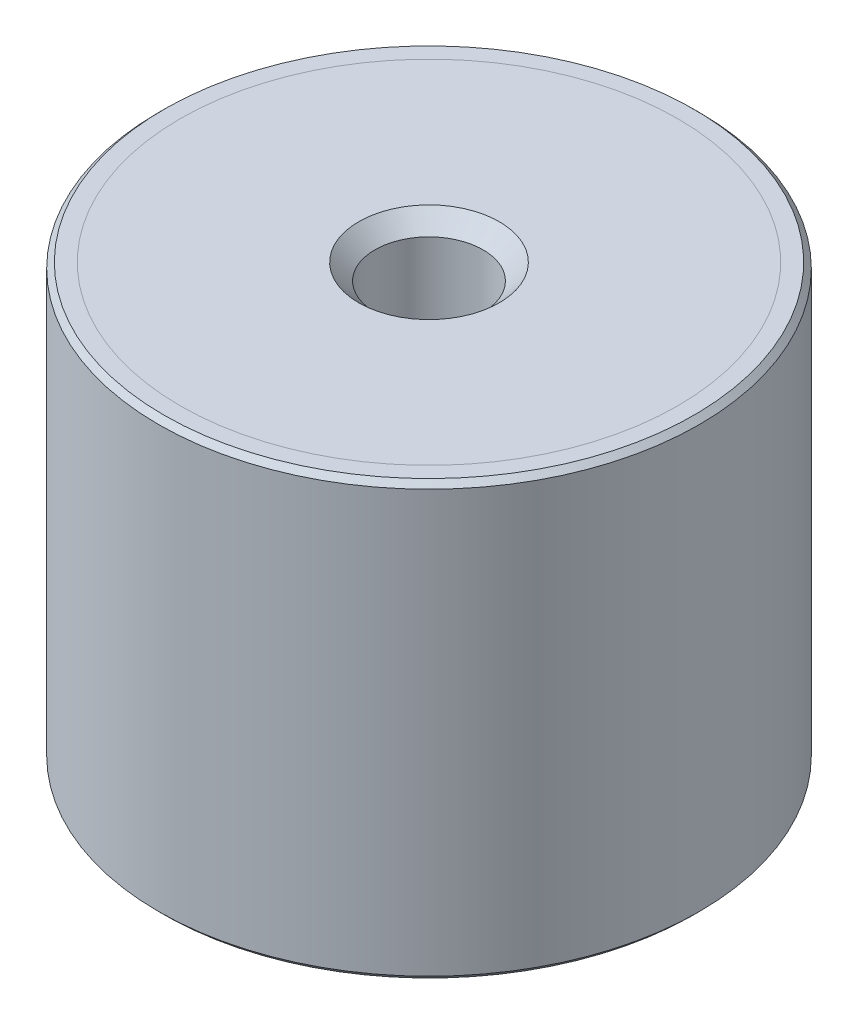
ISO-10303-21;
HEADER;
FILE_DESCRIPTION(('STEP AP214'),'2;1');
FILE_NAME('part.step','',(''),(''),'','','');
FILE_SCHEMA(('AUTOMOTIVE_DESIGN { 1 0 10303 214 1 1 1 1 }'));
ENDSEC;
DATA;
#1=APPLICATION_CONTEXT('core data for automotive mechanical design processes');
#2=APPLICATION_PROTOCOL_DEFINITION('international standard','automotive_design',2000,#1);
#3=PRODUCT_CONTEXT('',#1,'mechanical');
#4=PRODUCT('Part','Part','',(#3));
#5=PRODUCT_RELATED_PRODUCT_CATEGORY('part','',(#4));
#6=PRODUCT_DEFINITION_FORMATION('','',#4);
#7=PRODUCT_DEFINITION_CONTEXT('part definition',#1,'design');
#8=PRODUCT_DEFINITION('design','',#6,#7);
#9=PRODUCT_DEFINITION_SHAPE('','',#8);
#10=(LENGTH_UNIT() NAMED_UNIT(*) SI_UNIT(.MILLI.,.METRE.));
#11=(NAMED_UNIT(*) PLANE_ANGLE_UNIT() SI_UNIT($,.RADIAN.));
#12=(NAMED_UNIT(*) SI_UNIT($,.STERADIAN.) SOLID_ANGLE_UNIT());
#13=UNCERTAINTY_MEASURE_WITH_UNIT(LENGTH_MEASURE(1.E-05),#10,'distance_accuracy_value','');
#14=(GEOMETRIC_REPRESENTATION_CONTEXT(3) GLOBAL_UNCERTAINTY_ASSIGNED_CONTEXT((#13)) GLOBAL_UNIT_ASSIGNED_CONTEXT((#10,
#11,#12)) REPRESENTATION_CONTEXT('',''));
#15=CARTESIAN_POINT('',(0.,0.,0.));
#16=DIRECTION('',(0.,0.,1.));
#17=DIRECTION('',(1.,0.,0.));
#18=AXIS2_PLACEMENT_3D('',#15,#16,#17);
#19=CARTESIAN_POINT('',(0.,-37.,5.));
#20=DIRECTION('',(0.,1.,0.));
#21=DIRECTION('',(0.,0.,1.));
#22=AXIS2_PLACEMENT_3D('',#19,#20,#21);
#23=PLANE('',#22);
#24=CARTESIAN_POINT('',(0.,-37.,0.));
#25=DIRECTION('',(0.,1.,0.));
#26=DIRECTION('',(0.,0.,1.));
#27=AXIS2_PLACEMENT_3D('',#24,#25,#26);
#28=CIRCLE('',#27,23.);
#29=CARTESIAN_POINT('',(0.,-37.,23.));
#30=VERTEX_POINT('',#29);
#31=EDGE_CURVE('P0_E25',#30,#30,#28,.T.);
#32=ORIENTED_EDGE('',*,*,#31,.T.);
#33=EDGE_LOOP('',(#32));
#34=FACE_BOUND('',#33,.T.);
#35=CARTESIAN_POINT('',(0.,-37.,0.));
#36=DIRECTION('',(0.,1.,0.));
#37=DIRECTION('',(0.,0.,1.));
#38=AXIS2_PLACEMENT_3D('',#35,#36,#37);
#39=CIRCLE('',#38,5.);
#40=CARTESIAN_POINT('',(0.,-37.,5.));
#41=VERTEX_POINT('',#40);
#42=EDGE_CURVE('P0_E21',#41,#41,#39,.T.);
#43=ORIENTED_EDGE('',*,*,#42,.F.);
#44=EDGE_LOOP('',(#43));
#45=FACE_BOUND('',#44,.T.);
#46=ADVANCED_FACE('P0_F14',(#34,#45),#23,.T.);
#47=CARTESIAN_POINT('',(0.,31.0340428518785,0.));
#48=DIRECTION('',(0.,1.,0.));
#49=DIRECTION('',(0.,0.,1.));
#50=AXIS2_PLACEMENT_3D('',#47,#48,#49);
#51=CYLINDRICAL_SURFACE('',#50,23.);
#52=CARTESIAN_POINT('',(0.,-38.5,0.));
#53=DIRECTION('',(0.,1.,0.));
#54=DIRECTION('',(0.,0.,1.));
#55=AXIS2_PLACEMENT_3D('',#52,#53,#54);
#56=CIRCLE('',#55,23.);
#57=CARTESIAN_POINT('',(0.,-38.5,23.));
#58=VERTEX_POINT('',#57);
#59=EDGE_CURVE('P0_E29',#58,#58,#56,.T.);
#60=ORIENTED_EDGE('',*,*,#59,.T.);
#61=EDGE_LOOP('',(#60));
#62=FACE_BOUND('',#61,.T.);
#63=ORIENTED_EDGE('',*,*,#31,.F.);
#64=EDGE_LOOP('',(#63));
#65=FACE_BOUND('',#64,.T.);
#66=ADVANCED_FACE('P0_F35',(#62,#65),#51,.T.);
#67=CARTESIAN_POINT('',(0.,-38.5,23.));
#68=DIRECTION('',(0.,-1.,0.));
#69=DIRECTION('',(0.,0.,-1.));
#70=AXIS2_PLACEMENT_3D('',#67,#68,#69);
#71=PLANE('',#70);
#72=CARTESIAN_POINT('',(0.,-38.5,0.));
#73=DIRECTION('',(0.,-1.,0.));
#74=DIRECTION('',(0.,0.,-1.));
#75=AXIS2_PLACEMENT_3D('',#72,#73,#74);
#76=CIRCLE('',#75,6.5);
#77=CARTESIAN_POINT('',(0.,-38.5,-6.5));
#78=VERTEX_POINT('',#77);
#79=EDGE_CURVE('P0_E10',#78,#78,#76,.F.);
#80=ORIENTED_EDGE('',*,*,#79,.T.);
#81=EDGE_LOOP('',(#80));
#82=FACE_BOUND('',#81,.T.);
#83=ORIENTED_EDGE('',*,*,#59,.F.);
#84=EDGE_LOOP('',(#83));
#85=FACE_BOUND('',#84,.T.);
#86=ADVANCED_FACE('P0_F38',(#82,#85),#71,.T.);
#87=CARTESIAN_POINT('',(0.,-38.5,0.));
#88=DIRECTION('',(0.,-1.,0.));
#89=DIRECTION('',(0.,0.,-1.));
#90=AXIS2_PLACEMENT_3D('',#87,#88,#89);
#91=CONICAL_SURFACE('',#90,6.5,0.785398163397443);
#92=ORIENTED_EDGE('',*,*,#42,.T.);
#93=EDGE_LOOP('',(#92));
#94=FACE_BOUND('',#93,.T.);
#95=ORIENTED_EDGE('',*,*,#79,.F.);
#96=EDGE_LOOP('',(#95));
#97=FACE_BOUND('',#96,.T.);
#98=ADVANCED_FACE('P0_F16',(#94,#97),#91,.F.);
#99=CLOSED_SHELL('',(#46,#66,#86,#98));
#100=MANIFOLD_SOLID_BREP('P0_B1',#99);
#101=CARTESIAN_POINT('',(0.,1.5,5.));
#102=DIRECTION('',(0.,1.,0.));
#103=DIRECTION('',(0.,0.,1.));
#104=AXIS2_PLACEMENT_3D('',#101,#102,#103);
#105=PLANE('',#104);
#106=CARTESIAN_POINT('',(0.,1.5,0.));
#107=DIRECTION('',(0.,1.,0.));
#108=DIRECTION('',(0.,0.,1.));
#109=AXIS2_PLACEMENT_3D('',#106,#107,#108);
#110=CIRCLE('',#109,6.5);
#111=CARTESIAN_POINT('',(0.,1.5,6.5));
#112=VERTEX_POINT('',#111);
#113=EDGE_CURVE('P1_E10',#112,#112,#110,.F.);
#114=ORIENTED_EDGE('',*,*,#113,.T.);
#115=EDGE_LOOP('',(#114));
#116=FACE_BOUND('',#115,.T.);
#117=CARTESIAN_POINT('',(0.,1.5,0.));
#118=DIRECTION('',(0.,1.,0.));
#119=DIRECTION('',(0.,0.,1.));
#120=AXIS2_PLACEMENT_3D('',#117,#118,#119);
#121=CIRCLE('',#120,23.);
#122=CARTESIAN_POINT('',(0.,1.5,23.));
#123=VERTEX_POINT('',#122);
#124=EDGE_CURVE('P1_E21',#123,#123,#121,.T.);
#125=ORIENTED_EDGE('',*,*,#124,.T.);
#126=EDGE_LOOP('',(#125));
#127=FACE_BOUND('',#126,.T.);
#128=ADVANCED_FACE('P1_F14',(#116,#127),#105,.T.);
#129=CARTESIAN_POINT('',(0.,69.5340428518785,0.));
#130=DIRECTION('',(0.,1.,0.));
#131=DIRECTION('',(0.,0.,1.));
#132=AXIS2_PLACEMENT_3D('',#129,#130,#131);
#133=CYLINDRICAL_SURFACE('',#132,23.);
#134=CARTESIAN_POINT('',(0.,0.,0.));
#135=DIRECTION('',(0.,1.,0.));
#136=DIRECTION('',(0.,0.,1.));
#137=AXIS2_PLACEMENT_3D('',#134,#135,#136);
#138=CIRCLE('',#137,23.);
#139=CARTESIAN_POINT('',(0.,0.,23.));
#140=VERTEX_POINT('',#139);
#141=EDGE_CURVE('P1_E25',#140,#140,#138,.T.);
#142=ORIENTED_EDGE('',*,*,#141,.T.);
#143=EDGE_LOOP('',(#142));
#144=FACE_BOUND('',#143,.T.);
#145=ORIENTED_EDGE('',*,*,#124,.F.);
#146=EDGE_LOOP('',(#145));
#147=FACE_BOUND('',#146,.T.);
#148=ADVANCED_FACE('P1_F44',(#144,#147),#133,.T.);
#149=CARTESIAN_POINT('',(0.,0.,23.));
#150=DIRECTION('',(0.,-1.,0.));
#151=DIRECTION('',(0.,0.,-1.));
#152=AXIS2_PLACEMENT_3D('',#149,#150,#151);
#153=PLANE('',#152);
#154=CARTESIAN_POINT('',(0.,0.,0.));
#155=DIRECTION('',(0.,1.,0.));
#156=DIRECTION('',(0.,0.,1.));
#157=AXIS2_PLACEMENT_3D('',#154,#155,#156);
#158=CIRCLE('',#157,5.);
#159=CARTESIAN_POINT('',(0.,0.,5.));
#160=VERTEX_POINT('',#159);
#161=EDGE_CURVE('P1_E29',#160,#160,#158,.T.);
#162=ORIENTED_EDGE('',*,*,#161,.T.);
#163=EDGE_LOOP('',(#162));
#164=FACE_BOUND('',#163,.T.);
#165=ORIENTED_EDGE('',*,*,#141,.F.);
#166=EDGE_LOOP('',(#165));
#167=FACE_BOUND('',#166,.T.);
#168=ADVANCED_FACE('P1_F35',(#164,#167),#153,.T.);
#169=CARTESIAN_POINT('',(0.,0.,0.));
#170=DIRECTION('',(0.,1.,0.));
#171=DIRECTION('',(0.,0.,1.));
#172=AXIS2_PLACEMENT_3D('',#169,#170,#171);
#173=CONICAL_SURFACE('',#172,5.,0.78539816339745);
#174=ORIENTED_EDGE('',*,*,#113,.F.);
#175=EDGE_LOOP('',(#174));
#176=FACE_BOUND('',#175,.T.);
#177=ORIENTED_EDGE('',*,*,#161,.F.);
#178=EDGE_LOOP('',(#177));
#179=FACE_BOUND('',#178,.T.);
#180=ADVANCED_FACE('P1_F16',(#176,#179),#173,.F.);
#181=CLOSED_SHELL('',(#128,#148,#168,#180));
#182=MANIFOLD_SOLID_BREP('P1_B1',#181);
#183=CARTESIAN_POINT('',(0.,0.,0.));
#184=DIRECTION('',(0.,1.,0.));
#185=DIRECTION('',(0.,0.,1.));
#186=AXIS2_PLACEMENT_3D('',#183,#184,#185);
#187=PLANE('',#186);
#188=CARTESIAN_POINT('',(0.,0.,0.));
#189=DIRECTION('',(0.,1.,0.));
#190=DIRECTION('',(0.,0.,1.));
#191=AXIS2_PLACEMENT_3D('',#188,#189,#190);
#192=CIRCLE('',#191,5.);
#193=CARTESIAN_POINT('',(0.,0.,5.));
#194=VERTEX_POINT('',#193);
#195=EDGE_CURVE('P2_E46',#194,#194,#192,.T.);
#196=ORIENTED_EDGE('',*,*,#195,.F.);
#197=EDGE_LOOP('',(#196));
#198=FACE_BOUND('',#197,.T.);
#199=CARTESIAN_POINT('',(0.,0.,0.));
#200=DIRECTION('',(0.,1.,0.));
#201=DIRECTION('',(0.,0.,1.));
#202=AXIS2_PLACEMENT_3D('',#199,#200,#201);
#203=CIRCLE('',#202,23.);
#204=CARTESIAN_POINT('',(0.,0.,23.));
#205=VERTEX_POINT('',#204);
#206=EDGE_CURVE('P2_E33',#205,#205,#203,.T.);
#207=ORIENTED_EDGE('',*,*,#206,.T.);
#208=EDGE_LOOP('',(#207));
#209=FACE_BOUND('',#208,.T.);
#210=ADVANCED_FACE('P2_F13',(#198,#209),#187,.T.);
#211=CARTESIAN_POINT('',(0.,65.5134936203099,0.));
#212=DIRECTION('',(0.,1.,0.));
#213=DIRECTION('',(0.,0.,1.));
#214=AXIS2_PLACEMENT_3D('',#211,#212,#213);
#215=CYLINDRICAL_SURFACE('',#214,23.);
#216=CARTESIAN_POINT('',(0.,1.5,0.));
#217=DIRECTION('',(0.,1.,0.));
#218=DIRECTION('',(0.,0.,1.));
#219=AXIS2_PLACEMENT_3D('',#216,#217,#218);
#220=CIRCLE('',#219,23.);
#221=CARTESIAN_POINT('',(0.,1.5,23.));
#222=VERTEX_POINT('',#221);
#223=EDGE_CURVE('P2_E36',#222,#222,#220,.T.);
#224=ORIENTED_EDGE('',*,*,#223,.T.);
#225=EDGE_LOOP('',(#224));
#226=FACE_BOUND('',#225,.T.);
#227=ORIENTED_EDGE('',*,*,#206,.F.);
#228=EDGE_LOOP('',(#227));
#229=FACE_BOUND('',#228,.T.);
#230=ADVANCED_FACE('P2_F92',(#226,#229),#215,.F.);
#231=CARTESIAN_POINT('',(0.,1.5,23.));
#232=DIRECTION('',(0.,1.,0.));
#233=DIRECTION('',(0.,0.,1.));
#234=AXIS2_PLACEMENT_3D('',#231,#232,#233);
#235=PLANE('',#234);
#236=CARTESIAN_POINT('',(0.,1.5,0.));
#237=DIRECTION('',(0.,1.,0.));
#238=DIRECTION('',(0.,0.,1.));
#239=AXIS2_PLACEMENT_3D('',#236,#237,#238);
#240=CIRCLE('',#239,24.5);
#241=CARTESIAN_POINT('',(0.,1.5,24.5));
#242=VERTEX_POINT('',#241);
#243=EDGE_CURVE('P2_E9',#242,#242,#240,.T.);
#244=ORIENTED_EDGE('',*,*,#243,.T.);
#245=EDGE_LOOP('',(#244));
#246=FACE_BOUND('',#245,.T.);
#247=ORIENTED_EDGE('',*,*,#223,.F.);
#248=EDGE_LOOP('',(#247));
#249=FACE_BOUND('',#248,.T.);
#250=ADVANCED_FACE('P2_F88',(#246,#249),#235,.T.);
#251=CARTESIAN_POINT('',(0.,65.5134936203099,0.));
#252=DIRECTION('',(0.,1.,0.));
#253=DIRECTION('',(0.,0.,1.));
#254=AXIS2_PLACEMENT_3D('',#251,#252,#253);
#255=CYLINDRICAL_SURFACE('',#254,25.);
#256=CARTESIAN_POINT('',(0.,-38.,0.));
#257=DIRECTION('',(0.,-1.,0.));
#258=DIRECTION('',(0.,0.,-1.));
#259=AXIS2_PLACEMENT_3D('',#256,#257,#258);
#260=CIRCLE('',#259,25.);
#261=CARTESIAN_POINT('',(0.,-38.,-25.));
#262=VERTEX_POINT('',#261);
#263=EDGE_CURVE('P2_E24',#262,#262,#260,.F.);
#264=ORIENTED_EDGE('',*,*,#263,.T.);
#265=EDGE_LOOP('',(#264));
#266=FACE_BOUND('',#265,.T.);
#267=CARTESIAN_POINT('',(0.,1.,0.));
#268=DIRECTION('',(0.,1.,0.));
#269=DIRECTION('',(0.,0.,1.));
#270=AXIS2_PLACEMENT_3D('',#267,#268,#269);
#271=CIRCLE('',#270,25.);
#272=CARTESIAN_POINT('',(0.,1.,25.));
#273=VERTEX_POINT('',#272);
#274=EDGE_CURVE('P2_E28',#273,#273,#271,.F.);
#275=ORIENTED_EDGE('',*,*,#274,.T.);
#276=EDGE_LOOP('',(#275));
#277=FACE_BOUND('',#276,.T.);
#278=ADVANCED_FACE('P2_F82',(#266,#277),#255,.T.);
#279=CARTESIAN_POINT('',(0.,-38.5,25.));
#280=DIRECTION('',(0.,-1.,0.));
#281=DIRECTION('',(0.,0.,-1.));
#282=AXIS2_PLACEMENT_3D('',#279,#280,#281);
#283=PLANE('',#282);
#284=CARTESIAN_POINT('',(0.,-38.5,0.));
#285=DIRECTION('',(0.,-1.,0.));
#286=DIRECTION('',(0.,0.,-1.));
#287=AXIS2_PLACEMENT_3D('',#284,#285,#286);
#288=CIRCLE('',#287,24.5);
#289=CARTESIAN_POINT('',(0.,-38.5,-24.5));
#290=VERTEX_POINT('',#289);
#291=EDGE_CURVE('P2_E20',#290,#290,#288,.T.);
#292=ORIENTED_EDGE('',*,*,#291,.T.);
#293=EDGE_LOOP('',(#292));
#294=FACE_BOUND('',#293,.T.);
#295=CARTESIAN_POINT('',(0.,-38.5,0.));
#296=DIRECTION('',(0.,1.,0.));
#297=DIRECTION('',(0.,0.,1.));
#298=AXIS2_PLACEMENT_3D('',#295,#296,#297);
#299=CIRCLE('',#298,23.);
#300=CARTESIAN_POINT('',(0.,-38.5,23.));
#301=VERTEX_POINT('',#300);
#302=EDGE_CURVE('P2_E39',#301,#301,#299,.T.);
#303=ORIENTED_EDGE('',*,*,#302,.T.);
#304=EDGE_LOOP('',(#303));
#305=FACE_BOUND('',#304,.T.);
#306=ADVANCED_FACE('P2_F77',(#294,#305),#283,.T.);
#307=CARTESIAN_POINT('',(0.,65.5134936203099,0.));
#308=DIRECTION('',(0.,1.,0.));
#309=DIRECTION('',(0.,0.,1.));
#310=AXIS2_PLACEMENT_3D('',#307,#308,#309);
#311=CYLINDRICAL_SURFACE('',#310,23.);
#312=CARTESIAN_POINT('',(0.,-37.,0.));
#313=DIRECTION('',(0.,1.,0.));
#314=DIRECTION('',(0.,0.,1.));
#315=AXIS2_PLACEMENT_3D('',#312,#313,#314);
#316=CIRCLE('',#315,23.);
#317=CARTESIAN_POINT('',(0.,-37.,23.));
#318=VERTEX_POINT('',#317);
#319=EDGE_CURVE('P2_E42',#318,#318,#316,.T.);
#320=ORIENTED_EDGE('',*,*,#319,.T.);
#321=EDGE_LOOP('',(#320));
#322=FACE_BOUND('',#321,.T.);
#323=ORIENTED_EDGE('',*,*,#302,.F.);
#324=EDGE_LOOP('',(#323));
#325=FACE_BOUND('',#324,.T.);
#326=ADVANCED_FACE('P2_F71',(#322,#325),#311,.F.);
#327=CARTESIAN_POINT('',(0.,-37.,23.));
#328=DIRECTION('',(0.,-1.,0.));
#329=DIRECTION('',(0.,0.,-1.));
#330=AXIS2_PLACEMENT_3D('',#327,#328,#329);
#331=PLANE('',#330);
#332=CARTESIAN_POINT('',(0.,-37.,0.));
#333=DIRECTION('',(0.,-1.,0.));
#334=DIRECTION('',(0.,0.,-1.));
#335=AXIS2_PLACEMENT_3D('',#332,#333,#334);
#336=CIRCLE('',#335,5.);
#337=CARTESIAN_POINT('',(0.,-37.,-5.));
#338=VERTEX_POINT('',#337);
#339=EDGE_CURVE('P2_E52',#338,#338,#336,.T.);
#340=ORIENTED_EDGE('',*,*,#339,.F.);
#341=EDGE_LOOP('',(#340));
#342=FACE_BOUND('',#341,.T.);
#343=ORIENTED_EDGE('',*,*,#319,.F.);
#344=EDGE_LOOP('',(#343));
#345=FACE_BOUND('',#344,.T.);
#346=ADVANCED_FACE('P2_F67',(#342,#345),#331,.T.);
#347=CARTESIAN_POINT('',(0.,-38.,0.));
#348=DIRECTION('',(0.,1.,0.));
#349=DIRECTION('',(0.,0.,1.));
#350=AXIS2_PLACEMENT_3D('',#347,#348,#349);
#351=CONICAL_SURFACE('',#350,25.,0.785398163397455);
#352=ORIENTED_EDGE('',*,*,#291,.F.);
#353=EDGE_LOOP('',(#352));
#354=FACE_BOUND('',#353,.T.);
#355=ORIENTED_EDGE('',*,*,#263,.F.);
#356=EDGE_LOOP('',(#355));
#357=FACE_BOUND('',#356,.T.);
#358=ADVANCED_FACE('P2_F70',(#354,#357),#351,.T.);
#359=CARTESIAN_POINT('',(0.,1.5,0.));
#360=DIRECTION('',(0.,-1.,0.));
#361=DIRECTION('',(0.,0.,-1.));
#362=AXIS2_PLACEMENT_3D('',#359,#360,#361);
#363=CONICAL_SURFACE('',#362,24.5,0.785398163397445);
#364=ORIENTED_EDGE('',*,*,#274,.F.);
#365=EDGE_LOOP('',(#364));
#366=FACE_BOUND('',#365,.T.);
#367=ORIENTED_EDGE('',*,*,#243,.F.);
#368=EDGE_LOOP('',(#367));
#369=FACE_BOUND('',#368,.T.);
#370=ADVANCED_FACE('P2_F15',(#366,#369),#363,.T.);
#371=CARTESIAN_POINT('',(0.,-8.5,0.));
#372=DIRECTION('',(0.,1.,0.));
#373=DIRECTION('',(0.,0.,1.));
#374=AXIS2_PLACEMENT_3D('',#371,#372,#373);
#375=CYLINDRICAL_SURFACE('',#374,5.);
#376=CARTESIAN_POINT('',(0.,-8.5,0.));
#377=DIRECTION('',(0.,1.,0.));
#378=DIRECTION('',(0.,0.,1.));
#379=AXIS2_PLACEMENT_3D('',#376,#377,#378);
#380=CIRCLE('',#379,5.);
#381=CARTESIAN_POINT('',(0.,-8.5,5.));
#382=VERTEX_POINT('',#381);
#383=EDGE_CURVE('P2_E45',#382,#382,#380,.T.);
#384=ORIENTED_EDGE('',*,*,#383,.F.);
#385=EDGE_LOOP('',(#384));
#386=FACE_BOUND('',#385,.T.);
#387=ORIENTED_EDGE('',*,*,#195,.T.);
#388=EDGE_LOOP('',(#387));
#389=FACE_BOUND('',#388,.T.);
#390=ADVANCED_FACE('P2_F108',(#386,#389),#375,.F.);
#391=CARTESIAN_POINT('',(0.,-8.5,0.));
#392=DIRECTION('',(0.,1.,0.));
#393=DIRECTION('',(0.,0.,1.));
#394=AXIS2_PLACEMENT_3D('',#391,#392,#393);
#395=PLANE('',#394);
#396=ORIENTED_EDGE('',*,*,#383,.T.);
#397=EDGE_LOOP('',(#396));
#398=FACE_BOUND('',#397,.T.);
#399=ADVANCED_FACE('P2_F63',(#398),#395,.T.);
#400=CARTESIAN_POINT('',(0.,-28.5,0.));
#401=DIRECTION('',(0.,-1.,0.));
#402=DIRECTION('',(0.,0.,-1.));
#403=AXIS2_PLACEMENT_3D('',#400,#401,#402);
#404=CYLINDRICAL_SURFACE('',#403,5.);
#405=CARTESIAN_POINT('',(0.,-28.5,0.));
#406=DIRECTION('',(0.,-1.,0.));
#407=DIRECTION('',(0.,0.,-1.));
#408=AXIS2_PLACEMENT_3D('',#405,#406,#407);
#409=CIRCLE('',#408,5.);
#410=CARTESIAN_POINT('',(0.,-28.5,-5.));
#411=VERTEX_POINT('',#410);
#412=EDGE_CURVE('P2_E49',#411,#411,#409,.T.);
#413=ORIENTED_EDGE('',*,*,#412,.F.);
#414=EDGE_LOOP('',(#413));
#415=FACE_BOUND('',#414,.T.);
#416=ORIENTED_EDGE('',*,*,#339,.T.);
#417=EDGE_LOOP('',(#416));
#418=FACE_BOUND('',#417,.T.);
#419=ADVANCED_FACE('P2_F60',(#415,#418),#404,.F.);
#420=CARTESIAN_POINT('',(0.,-28.5,0.));
#421=DIRECTION('',(0.,-1.,0.));
#422=DIRECTION('',(0.,0.,-1.));
#423=AXIS2_PLACEMENT_3D('',#420,#421,#422);
#424=PLANE('',#423);
#425=ORIENTED_EDGE('',*,*,#412,.T.);
#426=EDGE_LOOP('',(#425));
#427=FACE_BOUND('',#426,.T.);
#428=ADVANCED_FACE('P2_F58',(#427),#424,.T.);
#429=CLOSED_SHELL('',(#210,#230,#250,#278,#306,#326,#346,#358,#370,#390,#399,#419,#428));
#430=MANIFOLD_SOLID_BREP('P2_B1',#429);
#431=ADVANCED_BREP_SHAPE_REPRESENTATION('',(#18,#100,#182,#430),#14);
#432=SHAPE_DEFINITION_REPRESENTATION(#9,#431);
ENDSEC;
END-ISO-10303-21;
